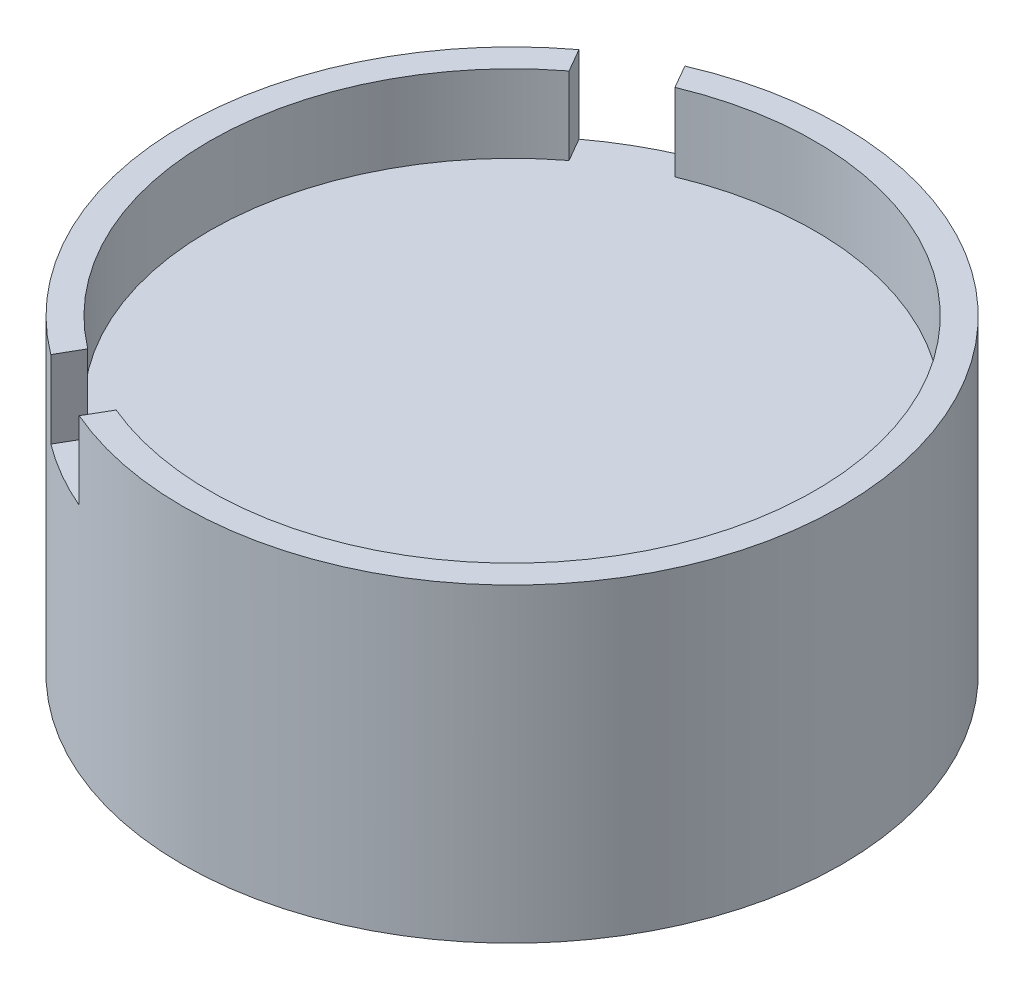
ISO-10303-21;
HEADER;
FILE_DESCRIPTION(('STEP AP214'),'2;1');
FILE_NAME('part.step','',(''),(''),'','','');
FILE_SCHEMA(('AUTOMOTIVE_DESIGN { 1 0 10303 214 1 1 1 1 }'));
ENDSEC;
DATA;
#1=APPLICATION_CONTEXT('core data for automotive mechanical design processes');
#2=APPLICATION_PROTOCOL_DEFINITION('international standard','automotive_design',2000,#1);
#3=PRODUCT_CONTEXT('',#1,'mechanical');
#4=PRODUCT('Part','Part','',(#3));
#5=PRODUCT_RELATED_PRODUCT_CATEGORY('part','',(#4));
#6=PRODUCT_DEFINITION_FORMATION('','',#4);
#7=PRODUCT_DEFINITION_CONTEXT('part definition',#1,'design');
#8=PRODUCT_DEFINITION('design','',#6,#7);
#9=PRODUCT_DEFINITION_SHAPE('','',#8);
#10=(LENGTH_UNIT() NAMED_UNIT(*) SI_UNIT(.MILLI.,.METRE.));
#11=(NAMED_UNIT(*) PLANE_ANGLE_UNIT() SI_UNIT($,.RADIAN.));
#12=(NAMED_UNIT(*) SI_UNIT($,.STERADIAN.) SOLID_ANGLE_UNIT());
#13=UNCERTAINTY_MEASURE_WITH_UNIT(LENGTH_MEASURE(1.E-05),#10,'distance_accuracy_value','');
#14=(GEOMETRIC_REPRESENTATION_CONTEXT(3) GLOBAL_UNCERTAINTY_ASSIGNED_CONTEXT((#13)) GLOBAL_UNIT_ASSIGNED_CONTEXT((#10,
#11,#12)) REPRESENTATION_CONTEXT('',''));
#15=CARTESIAN_POINT('',(0.,0.,0.));
#16=DIRECTION('',(0.,0.,1.));
#17=DIRECTION('',(1.,0.,0.));
#18=AXIS2_PLACEMENT_3D('',#15,#16,#17);
#19=CARTESIAN_POINT('',(0.,5.,0.));
#20=DIRECTION('',(0.,1.,0.));
#21=DIRECTION('',(0.,0.,1.));
#22=AXIS2_PLACEMENT_3D('',#19,#20,#21);
#23=PLANE('',#22);
#24=DIRECTION('',(-0.499999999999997,0.,0.86602540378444));
#25=VECTOR('',#24,1.);
#26=CARTESIAN_POINT('',(-5.92234321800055,5.,7.75779935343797));
#27=LINE('',#26,#25);
#28=CARTESIAN_POINT('',(-5.92234321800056,5.,7.75779935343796));
#29=VERTEX_POINT('',#28);
#30=CARTESIAN_POINT('',(-6.35813894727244,5.,8.51261969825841));
#31=VERTEX_POINT('',#30);
#32=EDGE_CURVE('E105',#29,#31,#27,.T.);
#33=ORIENTED_EDGE('',*,*,#32,.F.);
#34=CARTESIAN_POINT('',(0.,5.,0.));
#35=DIRECTION('',(0.,1.,0.));
#36=DIRECTION('',(0.,0.,1.));
#37=AXIS2_PLACEMENT_3D('',#34,#35,#36);
#38=CIRCLE('',#37,9.75999999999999);
#39=CARTESIAN_POINT('',(-5.92234321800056,5.,-7.75779935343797));
#40=VERTEX_POINT('',#39);
#41=EDGE_CURVE('E124',#40,#29,#38,.T.);
#42=ORIENTED_EDGE('',*,*,#41,.F.);
#43=DIRECTION('',(0.499999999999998,0.,0.866025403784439));
#44=VECTOR('',#43,1.);
#45=CARTESIAN_POINT('',(-6.35813894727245,5.,-8.51261969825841));
#46=LINE('',#45,#44);
#47=CARTESIAN_POINT('',(-6.35813894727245,5.,-8.51261969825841));
#48=VERTEX_POINT('',#47);
#49=EDGE_CURVE('E140',#48,#40,#46,.T.);
#50=ORIENTED_EDGE('',*,*,#49,.F.);
#51=CARTESIAN_POINT('',(0.,5.,0.));
#52=DIRECTION('',(0.,1.,0.));
#53=DIRECTION('',(0.,0.,1.));
#54=AXIS2_PLACEMENT_3D('',#51,#52,#53);
#55=CIRCLE('',#54,10.625);
#56=EDGE_CURVE('E11',#48,#31,#55,.T.);
#57=ORIENTED_EDGE('',*,*,#56,.T.);
#58=EDGE_LOOP('',(#33,#42,#50,#57));
#59=FACE_BOUND('',#58,.T.);
#60=ADVANCED_FACE('F30',(#59),#23,.T.);
#61=CARTESIAN_POINT('',(0.,2.5,0.));
#62=DIRECTION('',(0.,1.,0.));
#63=DIRECTION('',(0.,0.,1.));
#64=AXIS2_PLACEMENT_3D('',#61,#62,#63);
#65=CYLINDRICAL_SURFACE('',#64,9.75999999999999);
#66=ORIENTED_EDGE('',*,*,#41,.T.);
#67=DIRECTION('',(0.,1.,0.));
#68=VECTOR('',#67,1.);
#69=CARTESIAN_POINT('',(-5.92234321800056,-0.783865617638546,7.75779935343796));
#70=LINE('',#69,#68);
#71=CARTESIAN_POINT('',(-5.92234321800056,2.5,7.75779935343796));
#72=VERTEX_POINT('',#71);
#73=EDGE_CURVE('E148',#72,#29,#70,.T.);
#74=ORIENTED_EDGE('',*,*,#73,.F.);
#75=CARTESIAN_POINT('',(0.,2.5,0.));
#76=DIRECTION('',(0.,1.,0.));
#77=DIRECTION('',(0.,0.,1.));
#78=AXIS2_PLACEMENT_3D('',#75,#76,#77);
#79=CIRCLE('',#78,9.75999999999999);
#80=CARTESIAN_POINT('',(-5.92234321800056,2.5,-7.75779935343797));
#81=VERTEX_POINT('',#80);
#82=EDGE_CURVE('E121',#81,#72,#79,.T.);
#83=ORIENTED_EDGE('',*,*,#82,.F.);
#84=DIRECTION('',(0.,1.,0.));
#85=VECTOR('',#84,1.);
#86=CARTESIAN_POINT('',(-5.92234321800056,-0.783865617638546,-7.75779935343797));
#87=LINE('',#86,#85);
#88=EDGE_CURVE('E131',#81,#40,#87,.T.);
#89=ORIENTED_EDGE('',*,*,#88,.T.);
#90=EDGE_LOOP('',(#66,#74,#83,#89));
#91=FACE_BOUND('',#90,.T.);
#92=ADVANCED_FACE('F171',(#91),#65,.F.);
#93=CARTESIAN_POINT('',(0.,5.,0.));
#94=DIRECTION('',(0.,-1.,0.));
#95=DIRECTION('',(0.,0.,-1.));
#96=AXIS2_PLACEMENT_3D('',#93,#94,#95);
#97=CYLINDRICAL_SURFACE('',#96,10.625);
#98=CARTESIAN_POINT('',(0.,2.5,0.));
#99=DIRECTION('',(0.,1.,0.));
#100=DIRECTION('',(0.,0.,1.));
#101=AXIS2_PLACEMENT_3D('',#98,#99,#100);
#102=CIRCLE('',#101,10.625);
#103=CARTESIAN_POINT('',(-4.19307543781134,2.5,9.7626196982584));
#104=VERTEX_POINT('',#103);
#105=CARTESIAN_POINT('',(-6.35813894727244,2.5,8.51261969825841));
#106=VERTEX_POINT('',#105);
#107=EDGE_CURVE('E145',#104,#106,#102,.F.);
#108=ORIENTED_EDGE('',*,*,#107,.T.);
#109=DIRECTION('',(0.,1.,0.));
#110=VECTOR('',#109,1.);
#111=CARTESIAN_POINT('',(-6.35813894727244,-0.783865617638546,8.51261969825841));
#112=LINE('',#111,#110);
#113=EDGE_CURVE('E150',#106,#31,#112,.T.);
#114=ORIENTED_EDGE('',*,*,#113,.T.);
#115=ORIENTED_EDGE('',*,*,#56,.F.);
#116=DIRECTION('',(0.,1.,0.));
#117=VECTOR('',#116,1.);
#118=CARTESIAN_POINT('',(-6.35813894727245,-0.783865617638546,-8.51261969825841));
#119=LINE('',#118,#117);
#120=CARTESIAN_POINT('',(-6.35813894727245,2.5,-8.51261969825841));
#121=VERTEX_POINT('',#120);
#122=EDGE_CURVE('E129',#121,#48,#119,.T.);
#123=ORIENTED_EDGE('',*,*,#122,.F.);
#124=CARTESIAN_POINT('',(0.,2.5,0.));
#125=DIRECTION('',(0.,1.,0.));
#126=DIRECTION('',(0.,0.,1.));
#127=AXIS2_PLACEMENT_3D('',#124,#125,#126);
#128=CIRCLE('',#127,10.625);
#129=CARTESIAN_POINT('',(-4.19307543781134,2.5,-9.76261969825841));
#130=VERTEX_POINT('',#129);
#131=EDGE_CURVE('E128',#121,#130,#128,.F.);
#132=ORIENTED_EDGE('',*,*,#131,.T.);
#133=DIRECTION('',(0.,1.,0.));
#134=VECTOR('',#133,1.);
#135=CARTESIAN_POINT('',(-4.19307543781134,-0.783865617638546,-9.76261969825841));
#136=LINE('',#135,#134);
#137=CARTESIAN_POINT('',(-4.19307543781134,5.,-9.76261969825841));
#138=VERTEX_POINT('',#137);
#139=EDGE_CURVE('E119',#130,#138,#136,.T.);
#140=ORIENTED_EDGE('',*,*,#139,.T.);
#141=CARTESIAN_POINT('',(-4.19307543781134,5.,9.7626196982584));
#142=VERTEX_POINT('',#141);
#143=EDGE_CURVE('E39',#142,#138,#55,.T.);
#144=ORIENTED_EDGE('',*,*,#143,.F.);
#145=DIRECTION('',(0.,1.,0.));
#146=VECTOR('',#145,1.);
#147=CARTESIAN_POINT('',(-4.19307543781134,-0.783865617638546,9.7626196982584));
#148=LINE('',#147,#146);
#149=EDGE_CURVE('E96',#104,#142,#148,.T.);
#150=ORIENTED_EDGE('',*,*,#149,.F.);
#151=EDGE_LOOP('',(#108,#114,#115,#123,#132,#140,#144,#150));
#152=FACE_BOUND('',#151,.T.);
#153=CARTESIAN_POINT('',(0.,-5.,0.));
#154=DIRECTION('',(0.,1.,0.));
#155=DIRECTION('',(0.,0.,1.));
#156=AXIS2_PLACEMENT_3D('',#153,#154,#155);
#157=CIRCLE('',#156,10.625);
#158=CARTESIAN_POINT('',(0.,-5.,10.625));
#159=VERTEX_POINT('',#158);
#160=EDGE_CURVE('E34',#159,#159,#157,.T.);
#161=ORIENTED_EDGE('',*,*,#160,.T.);
#162=EDGE_LOOP('',(#161));
#163=FACE_BOUND('',#162,.T.);
#164=ADVANCED_FACE('F32',(#152,#163),#97,.T.);
#165=DIRECTION('',(0.499999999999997,0.,-0.86602540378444));
#166=VECTOR('',#165,1.);
#167=CARTESIAN_POINT('',(-3.75727970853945,5.,9.00779935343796));
#168=LINE('',#167,#166);
#169=CARTESIAN_POINT('',(-3.75727970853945,5.,9.00779935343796));
#170=VERTEX_POINT('',#169);
#171=EDGE_CURVE('E99',#142,#170,#168,.T.);
#172=ORIENTED_EDGE('',*,*,#171,.F.);
#173=ORIENTED_EDGE('',*,*,#143,.T.);
#174=DIRECTION('',(-0.499999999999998,0.,-0.86602540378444));
#175=VECTOR('',#174,1.);
#176=CARTESIAN_POINT('',(-4.19307543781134,5.,-9.76261969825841));
#177=LINE('',#176,#175);
#178=CARTESIAN_POINT('',(-3.75727970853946,5.,-9.00779935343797));
#179=VERTEX_POINT('',#178);
#180=EDGE_CURVE('E132',#179,#138,#177,.T.);
#181=ORIENTED_EDGE('',*,*,#180,.F.);
#182=EDGE_CURVE('E113',#170,#179,#38,.T.);
#183=ORIENTED_EDGE('',*,*,#182,.F.);
#184=EDGE_LOOP('',(#172,#173,#181,#183));
#185=FACE_BOUND('',#184,.T.);
#186=ADVANCED_FACE('F110',(#185),#23,.T.);
#187=CARTESIAN_POINT('',(0.,-5.,0.));
#188=DIRECTION('',(0.,1.,0.));
#189=DIRECTION('',(0.,0.,1.));
#190=AXIS2_PLACEMENT_3D('',#187,#188,#189);
#191=PLANE('',#190);
#192=CARTESIAN_POINT('',(0.,-5.,0.));
#193=DIRECTION('',(0.,-1.,0.));
#194=DIRECTION('',(0.,0.,-1.));
#195=AXIS2_PLACEMENT_3D('',#192,#193,#194);
#196=CIRCLE('',#195,1.5875);
#197=CARTESIAN_POINT('',(0.,-5.,-1.5875));
#198=VERTEX_POINT('',#197);
#199=EDGE_CURVE('E159',#198,#198,#196,.T.);
#200=ORIENTED_EDGE('',*,*,#199,.F.);
#201=EDGE_LOOP('',(#200));
#202=FACE_BOUND('',#201,.T.);
#203=ORIENTED_EDGE('',*,*,#160,.F.);
#204=EDGE_LOOP('',(#203));
#205=FACE_BOUND('',#204,.T.);
#206=ADVANCED_FACE('F165',(#202,#205),#191,.F.);
#207=CARTESIAN_POINT('',(-3.75727970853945,2.5,9.00779935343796));
#208=VERTEX_POINT('',#207);
#209=CARTESIAN_POINT('',(-3.75727970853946,2.5,-9.00779935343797));
#210=VERTEX_POINT('',#209);
#211=EDGE_CURVE('E125',#208,#210,#79,.T.);
#212=ORIENTED_EDGE('',*,*,#211,.F.);
#213=DIRECTION('',(0.,1.,0.));
#214=VECTOR('',#213,1.);
#215=CARTESIAN_POINT('',(-3.75727970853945,-0.783865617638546,9.00779935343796));
#216=LINE('',#215,#214);
#217=EDGE_CURVE('E104',#208,#170,#216,.T.);
#218=ORIENTED_EDGE('',*,*,#217,.T.);
#219=ORIENTED_EDGE('',*,*,#182,.T.);
#220=DIRECTION('',(0.,1.,0.));
#221=VECTOR('',#220,1.);
#222=CARTESIAN_POINT('',(-3.75727970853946,-0.783865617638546,-9.00779935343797));
#223=LINE('',#222,#221);
#224=EDGE_CURVE('E135',#210,#179,#223,.T.);
#225=ORIENTED_EDGE('',*,*,#224,.F.);
#226=EDGE_LOOP('',(#212,#218,#219,#225));
#227=FACE_BOUND('',#226,.T.);
#228=ADVANCED_FACE('F168',(#227),#65,.F.);
#229=CARTESIAN_POINT('',(0.,2.5,0.));
#230=DIRECTION('',(0.,1.,0.));
#231=DIRECTION('',(0.,0.,1.));
#232=AXIS2_PLACEMENT_3D('',#229,#230,#231);
#233=PLANE('',#232);
#234=ORIENTED_EDGE('',*,*,#211,.T.);
#235=DIRECTION('',(0.499999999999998,0.,0.86602540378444));
#236=VECTOR('',#235,1.);
#237=CARTESIAN_POINT('',(-4.19307543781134,2.5,-9.76261969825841));
#238=LINE('',#237,#236);
#239=EDGE_CURVE('E138',#130,#210,#238,.T.);
#240=ORIENTED_EDGE('',*,*,#239,.F.);
#241=ORIENTED_EDGE('',*,*,#131,.F.);
#242=DIRECTION('',(-0.499999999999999,0.,-0.86602540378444));
#243=VECTOR('',#242,1.);
#244=CARTESIAN_POINT('',(-6.35813894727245,2.5,-8.51261969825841));
#245=LINE('',#244,#243);
#246=EDGE_CURVE('E53',#81,#121,#245,.T.);
#247=ORIENTED_EDGE('',*,*,#246,.F.);
#248=ORIENTED_EDGE('',*,*,#82,.T.);
#249=DIRECTION('',(0.499999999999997,0.,-0.86602540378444));
#250=VECTOR('',#249,1.);
#251=CARTESIAN_POINT('',(-5.92234321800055,2.5,7.75779935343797));
#252=LINE('',#251,#250);
#253=EDGE_CURVE('E153',#106,#72,#252,.T.);
#254=ORIENTED_EDGE('',*,*,#253,.F.);
#255=ORIENTED_EDGE('',*,*,#107,.F.);
#256=DIRECTION('',(-0.499999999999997,0.,0.86602540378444));
#257=VECTOR('',#256,1.);
#258=CARTESIAN_POINT('',(-3.75727970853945,2.5,9.00779935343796));
#259=LINE('',#258,#257);
#260=EDGE_CURVE('E46',#208,#104,#259,.T.);
#261=ORIENTED_EDGE('',*,*,#260,.F.);
#262=EDGE_LOOP('',(#234,#240,#241,#247,#248,#254,#255,#261));
#263=FACE_BOUND('',#262,.T.);
#264=ADVANCED_FACE('F186',(#263),#233,.T.);
#265=CARTESIAN_POINT('',(-4.19307543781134,-0.783865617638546,-9.76261969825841));
#266=DIRECTION('',(0.86602540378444,0.,-0.499999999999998));
#267=DIRECTION('',(-0.499999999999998,0.,-0.86602540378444));
#268=AXIS2_PLACEMENT_3D('',#265,#266,#267);
#269=PLANE('',#268);
#270=ORIENTED_EDGE('',*,*,#239,.T.);
#271=ORIENTED_EDGE('',*,*,#224,.T.);
#272=ORIENTED_EDGE('',*,*,#180,.T.);
#273=ORIENTED_EDGE('',*,*,#139,.F.);
#274=EDGE_LOOP('',(#270,#271,#272,#273));
#275=FACE_BOUND('',#274,.T.);
#276=ADVANCED_FACE('F190',(#275),#269,.F.);
#277=CARTESIAN_POINT('',(-6.35813894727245,-0.783865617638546,-8.51261969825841));
#278=DIRECTION('',(-0.866025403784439,0.,0.499999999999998));
#279=DIRECTION('',(0.499999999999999,0.,0.86602540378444));
#280=AXIS2_PLACEMENT_3D('',#277,#278,#279);
#281=PLANE('',#280);
#282=ORIENTED_EDGE('',*,*,#246,.T.);
#283=ORIENTED_EDGE('',*,*,#122,.T.);
#284=ORIENTED_EDGE('',*,*,#49,.T.);
#285=ORIENTED_EDGE('',*,*,#88,.F.);
#286=EDGE_LOOP('',(#282,#283,#284,#285));
#287=FACE_BOUND('',#286,.T.);
#288=ADVANCED_FACE('F191',(#287),#281,.F.);
#289=CARTESIAN_POINT('',(-5.92234321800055,-0.783865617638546,7.75779935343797));
#290=DIRECTION('',(-0.86602540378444,0.,-0.499999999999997));
#291=DIRECTION('',(-0.499999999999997,0.,0.86602540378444));
#292=AXIS2_PLACEMENT_3D('',#289,#290,#291);
#293=PLANE('',#292);
#294=ORIENTED_EDGE('',*,*,#253,.T.);
#295=ORIENTED_EDGE('',*,*,#73,.T.);
#296=ORIENTED_EDGE('',*,*,#32,.T.);
#297=ORIENTED_EDGE('',*,*,#113,.F.);
#298=EDGE_LOOP('',(#294,#295,#296,#297));
#299=FACE_BOUND('',#298,.T.);
#300=ADVANCED_FACE('F194',(#299),#293,.F.);
#301=CARTESIAN_POINT('',(-3.75727970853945,-0.783865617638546,9.00779935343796));
#302=DIRECTION('',(0.86602540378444,0.,0.499999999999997));
#303=DIRECTION('',(0.499999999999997,0.,-0.86602540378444));
#304=AXIS2_PLACEMENT_3D('',#301,#302,#303);
#305=PLANE('',#304);
#306=ORIENTED_EDGE('',*,*,#260,.T.);
#307=ORIENTED_EDGE('',*,*,#149,.T.);
#308=ORIENTED_EDGE('',*,*,#171,.T.);
#309=ORIENTED_EDGE('',*,*,#217,.F.);
#310=EDGE_LOOP('',(#306,#307,#308,#309));
#311=FACE_BOUND('',#310,.T.);
#312=ADVANCED_FACE('F98',(#311),#305,.F.);
#313=CARTESIAN_POINT('',(0.,0.,0.));
#314=DIRECTION('',(0.,1.,0.));
#315=DIRECTION('',(0.,0.,1.));
#316=AXIS2_PLACEMENT_3D('',#313,#314,#315);
#317=PLANE('',#316);
#318=CARTESIAN_POINT('',(0.,0.,0.));
#319=DIRECTION('',(0.,-1.,0.));
#320=DIRECTION('',(0.,0.,-1.));
#321=AXIS2_PLACEMENT_3D('',#318,#319,#320);
#322=CIRCLE('',#321,1.5875);
#323=CARTESIAN_POINT('',(0.,0.,-1.5875));
#324=VERTEX_POINT('',#323);
#325=EDGE_CURVE('E142',#324,#324,#322,.T.);
#326=ORIENTED_EDGE('',*,*,#325,.T.);
#327=EDGE_LOOP('',(#326));
#328=FACE_BOUND('',#327,.T.);
#329=ADVANCED_FACE('F201',(#328),#317,.F.);
#330=CARTESIAN_POINT('',(0.,-5.,0.));
#331=DIRECTION('',(0.,-1.,0.));
#332=DIRECTION('',(0.,0.,-1.));
#333=AXIS2_PLACEMENT_3D('',#330,#331,#332);
#334=CYLINDRICAL_SURFACE('',#333,1.5875);
#335=ORIENTED_EDGE('',*,*,#325,.F.);
#336=EDGE_LOOP('',(#335));
#337=FACE_BOUND('',#336,.T.);
#338=ORIENTED_EDGE('',*,*,#199,.T.);
#339=EDGE_LOOP('',(#338));
#340=FACE_BOUND('',#339,.T.);
#341=ADVANCED_FACE('F163',(#337,#340),#334,.F.);
#342=CLOSED_SHELL('',(#60,#92,#164,#186,#206,#228,#264,#276,#288,#300,#312,#329,#341));
#343=MANIFOLD_SOLID_BREP('B2',#342);
#344=ADVANCED_BREP_SHAPE_REPRESENTATION('',(#18,#343),#14);
#345=SHAPE_DEFINITION_REPRESENTATION(#9,#344);
ENDSEC;
END-ISO-10303-21;
